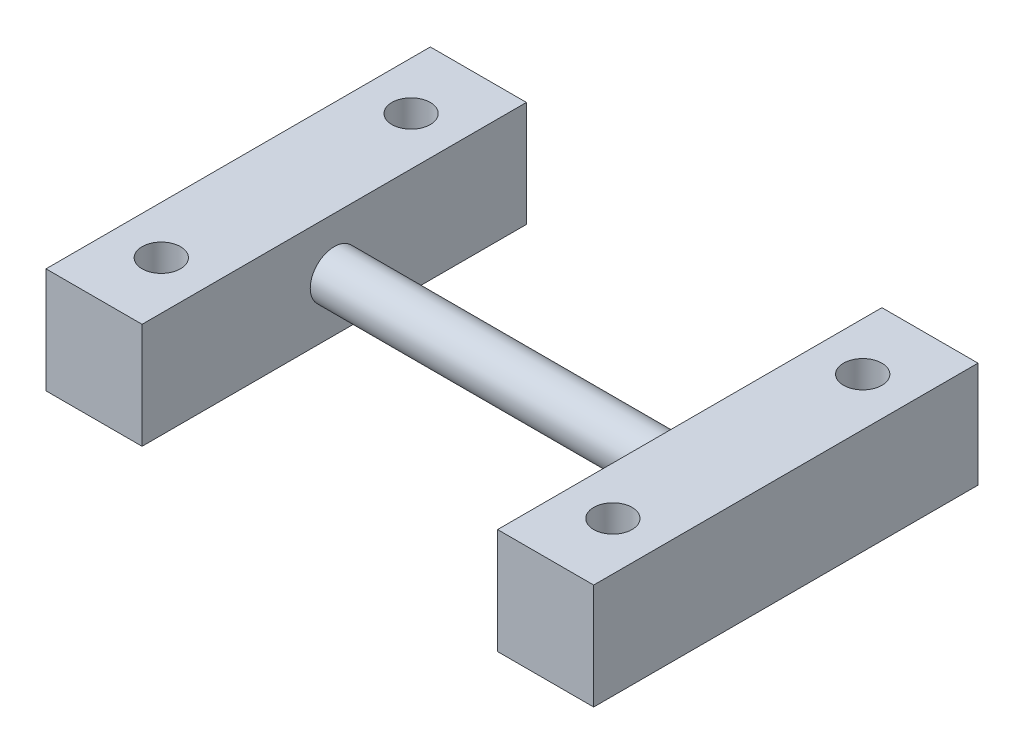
from build123d import *

# Parameters (mm, degrees)
SKETCH_1_W          = 10
SKETCH_1_H          = 40
SKETCH_1_R          = 2
EXTRUDE_1_DEPTH     = 22
EXTRUDE_1_2_DEPTH   = 22
EXTRUDE_2_REACH     = 67.521
SKETCH_2_R          = 2.5
SKETCH_3_W          = 57
SKETCH_3_H          = 40
CUT_EXTRUDE_1_DEPTH = 11


with BuildPart() as part:
    # Sketch 1 → Extrude 1 (new body)
    with BuildSketch(Plane(origin=(0, 0, 0), x_dir=(1, 0, 0), z_dir=(0, 1, 0))):
        with Locations((5, -20)):
            Rectangle(SKETCH_1_W, SKETCH_1_H)
        with Locations(Location((5, -7, 0), (0, 0, 270))):
            Circle(SKETCH_1_R, mode=Mode.SUBTRACT)
        with Locations(Location((5, -33, 0), (0, 0, 270))):
            Circle(SKETCH_1_R, mode=Mode.SUBTRACT)
    extrude(amount=EXTRUDE_1_DEPTH)


with BuildPart() as body_2:
    # Sketch 1 → Extrude 1 2 (new body)
    with BuildSketch(Plane(origin=(0, 0, 0), x_dir=(1, 0, 0), z_dir=(0, 1, 0))):
        with Locations((52, -20)):
            Rectangle(SKETCH_1_W, SKETCH_1_H)
        with Locations(Location((52, -7, 0), (0, 0, 270))):
            Circle(SKETCH_1_R, mode=Mode.SUBTRACT)
        with Locations(Location((52, -33, 0), (0, 0, 270))):
            Circle(SKETCH_1_R, mode=Mode.SUBTRACT)
    extrude(amount=EXTRUDE_1_2_DEPTH)

    # Sketch 2 → Extrude 2 (add, up to next)
    with BuildSketch(Plane(origin=(10, 0, 0), x_dir=(0, 0, -1), z_dir=(1, 0, 0)), mode=Mode.PRIVATE) as extrude_2_sk1:
        with Locations(Location((-20, 16.5, 0), (0, 0, 180))):
            Circle(SKETCH_2_R)
    extrude_2_tool1 = extrude(extrude_2_sk1.sketch, amount=EXTRUDE_2_REACH, mode=Mode.PRIVATE) - body_2.part

    add(part.part)  # Extrude 2 merges part
    add(extrude_2_tool1.solids().sort_by_distance((10, 16.5, 20))[0])

    # Sketch 3 → Cut-Extrude 1 (cut)
    with BuildSketch(Plane.XZ):
        with Locations((28.5, 20)):
            Rectangle(SKETCH_3_W, SKETCH_3_H)
    extrude(amount=-CUT_EXTRUDE_1_DEPTH, mode=Mode.SUBTRACT)


solid = body_2.part
